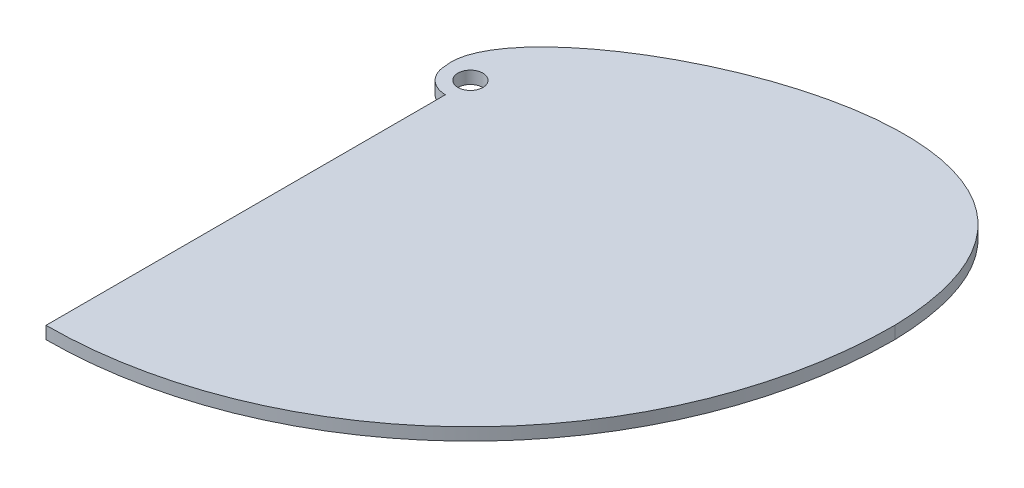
ISO-10303-21;
HEADER;
FILE_DESCRIPTION(('STEP AP214'),'2;1');
FILE_NAME('part.step','',(''),(''),'','','');
FILE_SCHEMA(('AUTOMOTIVE_DESIGN { 1 0 10303 214 1 1 1 1 }'));
ENDSEC;
DATA;
#1=APPLICATION_CONTEXT('core data for automotive mechanical design processes');
#2=APPLICATION_PROTOCOL_DEFINITION('international standard','automotive_design',2000,#1);
#3=PRODUCT_CONTEXT('',#1,'mechanical');
#4=PRODUCT('Part','Part','',(#3));
#5=PRODUCT_RELATED_PRODUCT_CATEGORY('part','',(#4));
#6=PRODUCT_DEFINITION_FORMATION('','',#4);
#7=PRODUCT_DEFINITION_CONTEXT('part definition',#1,'design');
#8=PRODUCT_DEFINITION('design','',#6,#7);
#9=PRODUCT_DEFINITION_SHAPE('','',#8);
#10=(LENGTH_UNIT() NAMED_UNIT(*) SI_UNIT(.MILLI.,.METRE.));
#11=(NAMED_UNIT(*) PLANE_ANGLE_UNIT() SI_UNIT($,.RADIAN.));
#12=(NAMED_UNIT(*) SI_UNIT($,.STERADIAN.) SOLID_ANGLE_UNIT());
#13=UNCERTAINTY_MEASURE_WITH_UNIT(LENGTH_MEASURE(1.E-05),#10,'distance_accuracy_value','');
#14=(GEOMETRIC_REPRESENTATION_CONTEXT(3) GLOBAL_UNCERTAINTY_ASSIGNED_CONTEXT((#13)) GLOBAL_UNIT_ASSIGNED_CONTEXT((#10,
#11,#12)) REPRESENTATION_CONTEXT('',''));
#15=CARTESIAN_POINT('',(0.,0.,0.));
#16=DIRECTION('',(0.,0.,1.));
#17=DIRECTION('',(1.,0.,0.));
#18=AXIS2_PLACEMENT_3D('',#15,#16,#17);
#19=CARTESIAN_POINT('',(48.2396834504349,3.175,-40.9274310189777));
#20=DIRECTION('',(0.,1.,0.));
#21=DIRECTION('',(0.,0.,1.));
#22=AXIS2_PLACEMENT_3D('',#19,#20,#21);
#23=PLANE('',#22);
#24=CARTESIAN_POINT('',(107.95,3.175,6.59538912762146E-13));
#25=CARTESIAN_POINT('',(105.864942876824,3.175,-82.508311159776));
#26=CARTESIAN_POINT('',(-11.0924536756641,3.175,-26.6315048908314));
#27=CARTESIAN_POINT('',(-6.35,3.175,0.));
#28=B_SPLINE_CURVE_WITH_KNOTS('',3,(#24,#25,#26,#27),.UNSPECIFIED.,.F.,.F.,(4,4),(0.,1.),.UNSPECIFIED.);
#29=CARTESIAN_POINT('',(107.95,3.175,0.));
#30=VERTEX_POINT('',#29);
#31=CARTESIAN_POINT('',(-6.35,3.175,0.));
#32=VERTEX_POINT('',#31);
#33=EDGE_CURVE('E85',#30,#32,#28,.T.);
#34=ORIENTED_EDGE('',*,*,#33,.T.);
#35=CARTESIAN_POINT('',(0.,3.175,0.));
#36=DIRECTION('',(0.,1.,0.));
#37=DIRECTION('',(0.,0.,1.));
#38=AXIS2_PLACEMENT_3D('',#35,#36,#37);
#39=CIRCLE('',#38,6.35);
#40=CARTESIAN_POINT('',(0.,3.175,6.35));
#41=VERTEX_POINT('',#40);
#42=EDGE_CURVE('E80',#32,#41,#39,.T.);
#43=ORIENTED_EDGE('',*,*,#42,.T.);
#44=DIRECTION('',(0.,0.,1.));
#45=VECTOR('',#44,1.);
#46=CARTESIAN_POINT('',(0.,3.175,6.35));
#47=LINE('',#46,#45);
#48=CARTESIAN_POINT('',(0.,3.175,107.95));
#49=VERTEX_POINT('',#48);
#50=EDGE_CURVE('E83',#41,#49,#47,.T.);
#51=ORIENTED_EDGE('',*,*,#50,.T.);
#52=CARTESIAN_POINT('',(0.,3.175,0.));
#53=DIRECTION('',(0.,1.,0.));
#54=DIRECTION('',(0.,0.,1.));
#55=AXIS2_PLACEMENT_3D('',#52,#53,#54);
#56=CIRCLE('',#55,107.95);
#57=EDGE_CURVE('E50',#49,#30,#56,.T.);
#58=ORIENTED_EDGE('',*,*,#57,.T.);
#59=EDGE_LOOP('',(#34,#43,#51,#58));
#60=FACE_BOUND('',#59,.T.);
#61=CARTESIAN_POINT('',(0.,3.175,0.));
#62=DIRECTION('',(0.,1.,0.));
#63=DIRECTION('',(0.,0.,1.));
#64=AXIS2_PLACEMENT_3D('',#61,#62,#63);
#65=CIRCLE('',#64,3.175);
#66=CARTESIAN_POINT('',(0.,3.175,3.175));
#67=VERTEX_POINT('',#66);
#68=EDGE_CURVE('E101',#67,#67,#65,.T.);
#69=ORIENTED_EDGE('',*,*,#68,.F.);
#70=EDGE_LOOP('',(#69));
#71=FACE_BOUND('',#70,.T.);
#72=ADVANCED_FACE('F32',(#60,#71),#23,.T.);
#73=CARTESIAN_POINT('',(48.2396834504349,0.,-40.9274310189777));
#74=DIRECTION('',(0.,1.,0.));
#75=DIRECTION('',(0.,0.,1.));
#76=AXIS2_PLACEMENT_3D('',#73,#74,#75);
#77=PLANE('',#76);
#78=CARTESIAN_POINT('',(107.95,0.,6.59538912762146E-13));
#79=CARTESIAN_POINT('',(105.864942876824,0.,-82.508311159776));
#80=CARTESIAN_POINT('',(-11.0924536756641,0.,-26.6315048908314));
#81=CARTESIAN_POINT('',(-6.35,0.,0.));
#82=B_SPLINE_CURVE_WITH_KNOTS('',3,(#78,#79,#80,#81),.UNSPECIFIED.,.F.,.F.,(4,4),(0.,1.),.UNSPECIFIED.);
#83=CARTESIAN_POINT('',(107.95,0.,0.));
#84=VERTEX_POINT('',#83);
#85=CARTESIAN_POINT('',(-6.35,0.,0.));
#86=VERTEX_POINT('',#85);
#87=EDGE_CURVE('E96',#84,#86,#82,.T.);
#88=ORIENTED_EDGE('',*,*,#87,.F.);
#89=CARTESIAN_POINT('',(0.,0.,0.));
#90=DIRECTION('',(0.,1.,0.));
#91=DIRECTION('',(0.,0.,1.));
#92=AXIS2_PLACEMENT_3D('',#89,#90,#91);
#93=CIRCLE('',#92,107.95);
#94=CARTESIAN_POINT('',(0.,0.,107.95));
#95=VERTEX_POINT('',#94);
#96=EDGE_CURVE('E73',#95,#84,#93,.T.);
#97=ORIENTED_EDGE('',*,*,#96,.F.);
#98=DIRECTION('',(0.,0.,1.));
#99=VECTOR('',#98,1.);
#100=CARTESIAN_POINT('',(0.,0.,6.35));
#101=LINE('',#100,#99);
#102=CARTESIAN_POINT('',(0.,0.,6.35));
#103=VERTEX_POINT('',#102);
#104=EDGE_CURVE('E67',#103,#95,#101,.T.);
#105=ORIENTED_EDGE('',*,*,#104,.F.);
#106=CARTESIAN_POINT('',(0.,0.,0.));
#107=DIRECTION('',(0.,1.,0.));
#108=DIRECTION('',(0.,0.,1.));
#109=AXIS2_PLACEMENT_3D('',#106,#107,#108);
#110=CIRCLE('',#109,6.35);
#111=EDGE_CURVE('E89',#86,#103,#110,.T.);
#112=ORIENTED_EDGE('',*,*,#111,.F.);
#113=EDGE_LOOP('',(#88,#97,#105,#112));
#114=FACE_BOUND('',#113,.T.);
#115=CARTESIAN_POINT('',(0.,0.,0.));
#116=DIRECTION('',(0.,1.,0.));
#117=DIRECTION('',(0.,0.,1.));
#118=AXIS2_PLACEMENT_3D('',#115,#116,#117);
#119=CIRCLE('',#118,3.175);
#120=CARTESIAN_POINT('',(0.,0.,3.175));
#121=VERTEX_POINT('',#120);
#122=EDGE_CURVE('E119',#121,#121,#119,.T.);
#123=ORIENTED_EDGE('',*,*,#122,.T.);
#124=EDGE_LOOP('',(#123));
#125=FACE_BOUND('',#124,.T.);
#126=ADVANCED_FACE('F112',(#114,#125),#77,.F.);
#127=DIRECTION('',(0.,-1.,0.));
#128=VECTOR('',#127,1.);
#129=SURFACE_OF_LINEAR_EXTRUSION('',#28,#128);
#130=ORIENTED_EDGE('',*,*,#87,.T.);
#131=DIRECTION('',(0.,-1.,0.));
#132=VECTOR('',#131,1.);
#133=CARTESIAN_POINT('',(-6.35,3.175,0.));
#134=LINE('',#133,#132);
#135=EDGE_CURVE('E11',#32,#86,#134,.T.);
#136=ORIENTED_EDGE('',*,*,#135,.F.);
#137=ORIENTED_EDGE('',*,*,#33,.F.);
#138=DIRECTION('',(0.,-1.,0.));
#139=VECTOR('',#138,1.);
#140=CARTESIAN_POINT('',(107.95,3.175,0.));
#141=LINE('',#140,#139);
#142=EDGE_CURVE('E93',#30,#84,#141,.T.);
#143=ORIENTED_EDGE('',*,*,#142,.T.);
#144=EDGE_LOOP('',(#130,#136,#137,#143));
#145=FACE_BOUND('',#144,.T.);
#146=ADVANCED_FACE('F34',(#145),#129,.F.);
#147=CARTESIAN_POINT('',(0.,3.175,0.));
#148=DIRECTION('',(0.,-1.,0.));
#149=DIRECTION('',(0.,0.,-1.));
#150=AXIS2_PLACEMENT_3D('',#147,#148,#149);
#151=CYLINDRICAL_SURFACE('',#150,6.35);
#152=ORIENTED_EDGE('',*,*,#111,.T.);
#153=DIRECTION('',(0.,-1.,0.));
#154=VECTOR('',#153,1.);
#155=CARTESIAN_POINT('',(0.,3.175,6.35));
#156=LINE('',#155,#154);
#157=EDGE_CURVE('E42',#41,#103,#156,.T.);
#158=ORIENTED_EDGE('',*,*,#157,.F.);
#159=ORIENTED_EDGE('',*,*,#42,.F.);
#160=ORIENTED_EDGE('',*,*,#135,.T.);
#161=EDGE_LOOP('',(#152,#158,#159,#160));
#162=FACE_BOUND('',#161,.T.);
#163=ADVANCED_FACE('F88',(#162),#151,.T.);
#164=CARTESIAN_POINT('',(0.,3.175,6.35));
#165=DIRECTION('',(1.,0.,0.));
#166=DIRECTION('',(0.,0.,-1.));
#167=AXIS2_PLACEMENT_3D('',#164,#165,#166);
#168=PLANE('',#167);
#169=ORIENTED_EDGE('',*,*,#104,.T.);
#170=DIRECTION('',(0.,-1.,0.));
#171=VECTOR('',#170,1.);
#172=CARTESIAN_POINT('',(0.,3.175,107.95));
#173=LINE('',#172,#171);
#174=EDGE_CURVE('E90',#49,#95,#173,.T.);
#175=ORIENTED_EDGE('',*,*,#174,.F.);
#176=ORIENTED_EDGE('',*,*,#50,.F.);
#177=ORIENTED_EDGE('',*,*,#157,.T.);
#178=EDGE_LOOP('',(#169,#175,#176,#177));
#179=FACE_BOUND('',#178,.T.);
#180=ADVANCED_FACE('F91',(#179),#168,.F.);
#181=CARTESIAN_POINT('',(0.,3.175,0.));
#182=DIRECTION('',(0.,-1.,0.));
#183=DIRECTION('',(0.,0.,-1.));
#184=AXIS2_PLACEMENT_3D('',#181,#182,#183);
#185=CYLINDRICAL_SURFACE('',#184,107.95);
#186=ORIENTED_EDGE('',*,*,#96,.T.);
#187=ORIENTED_EDGE('',*,*,#142,.F.);
#188=ORIENTED_EDGE('',*,*,#57,.F.);
#189=ORIENTED_EDGE('',*,*,#174,.T.);
#190=EDGE_LOOP('',(#186,#187,#188,#189));
#191=FACE_BOUND('',#190,.T.);
#192=ADVANCED_FACE('F109',(#191),#185,.T.);
#193=CARTESIAN_POINT('',(0.,3.175,0.));
#194=DIRECTION('',(0.,-1.,0.));
#195=DIRECTION('',(0.,0.,-1.));
#196=AXIS2_PLACEMENT_3D('',#193,#194,#195);
#197=CYLINDRICAL_SURFACE('',#196,3.175);
#198=ORIENTED_EDGE('',*,*,#68,.T.);
#199=EDGE_LOOP('',(#198));
#200=FACE_BOUND('',#199,.T.);
#201=ORIENTED_EDGE('',*,*,#122,.F.);
#202=EDGE_LOOP('',(#201));
#203=FACE_BOUND('',#202,.T.);
#204=ADVANCED_FACE('F128',(#200,#203),#197,.F.);
#205=CLOSED_SHELL('',(#72,#126,#146,#163,#180,#192,#204));
#206=MANIFOLD_SOLID_BREP('B2',#205);
#207=ADVANCED_BREP_SHAPE_REPRESENTATION('',(#18,#206),#14);
#208=SHAPE_DEFINITION_REPRESENTATION(#9,#207);
ENDSEC;
END-ISO-10303-21;
